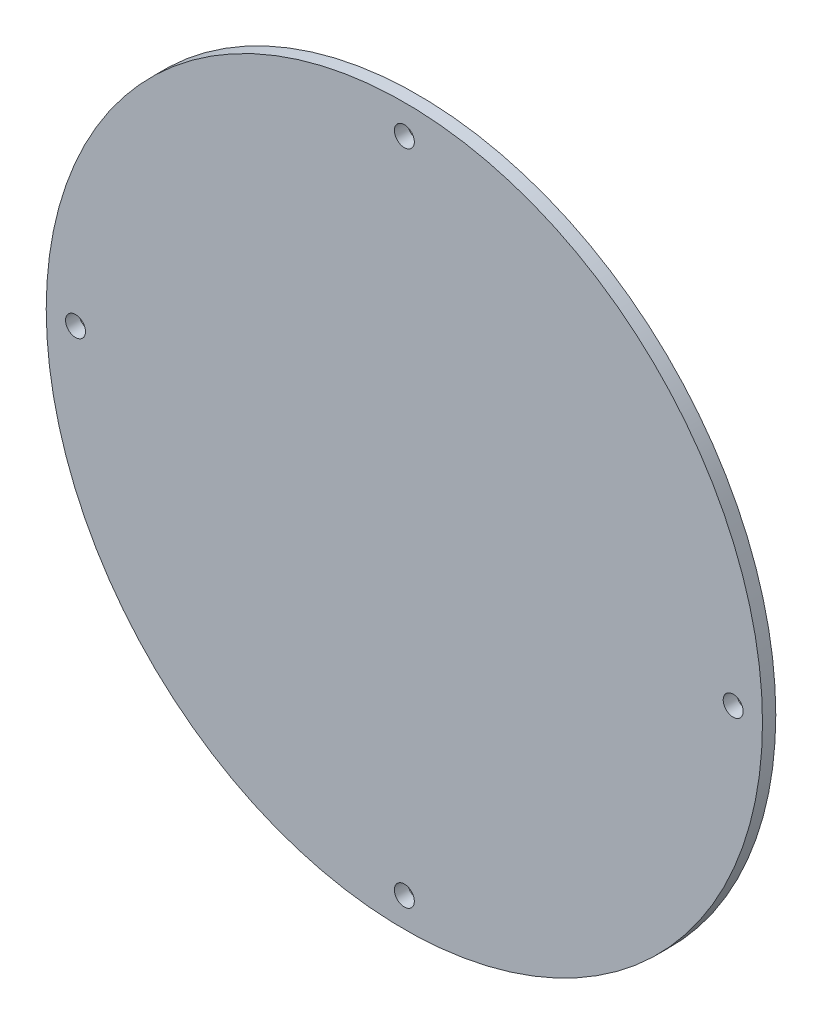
from build123d import *

# Parameters (mm, degrees)
SKETCH1_R           = 85.5
SKETCH1_R_2         = 2.38125
BOSS_EXTRUDE1_DEPTH = 3.175


with BuildPart() as part:
    # Sketch1 → Boss-Extrude1 (new body)
    with BuildSketch(Plane.XY):
        Circle(SKETCH1_R)
        with Locations((-78.5, 0)):
            Circle(SKETCH1_R_2, mode=Mode.SUBTRACT)
        with Locations((0, -78.5)):
            Circle(SKETCH1_R_2, mode=Mode.SUBTRACT)
        with Locations((78.5, 0)):
            Circle(SKETCH1_R_2, mode=Mode.SUBTRACT)
        with Locations((0, 78.5)):
            Circle(SKETCH1_R_2, mode=Mode.SUBTRACT)
    extrude(amount=BOSS_EXTRUDE1_DEPTH)


solid = part.part
